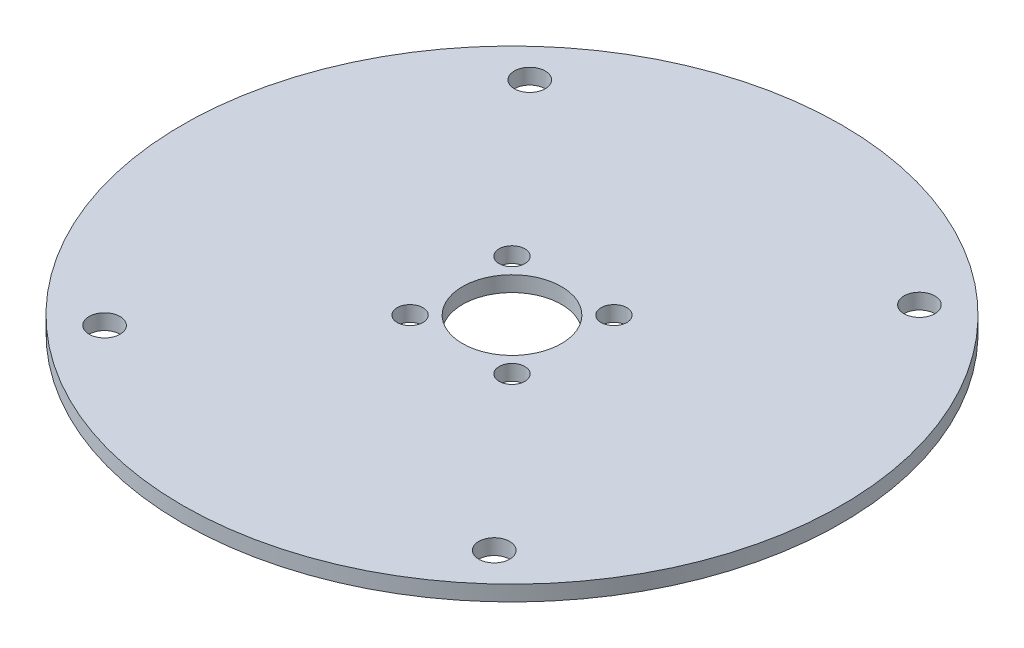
ISO-10303-21;
HEADER;
FILE_DESCRIPTION(('STEP AP214'),'2;1');
FILE_NAME('part.step','',(''),(''),'','','');
FILE_SCHEMA(('AUTOMOTIVE_DESIGN { 1 0 10303 214 1 1 1 1 }'));
ENDSEC;
DATA;
#1=APPLICATION_CONTEXT('core data for automotive mechanical design processes');
#2=APPLICATION_PROTOCOL_DEFINITION('international standard','automotive_design',2000,#1);
#3=PRODUCT_CONTEXT('',#1,'mechanical');
#4=PRODUCT('Part','Part','',(#3));
#5=PRODUCT_RELATED_PRODUCT_CATEGORY('part','',(#4));
#6=PRODUCT_DEFINITION_FORMATION('','',#4);
#7=PRODUCT_DEFINITION_CONTEXT('part definition',#1,'design');
#8=PRODUCT_DEFINITION('design','',#6,#7);
#9=PRODUCT_DEFINITION_SHAPE('','',#8);
#10=(LENGTH_UNIT() NAMED_UNIT(*) SI_UNIT(.MILLI.,.METRE.));
#11=(NAMED_UNIT(*) PLANE_ANGLE_UNIT() SI_UNIT($,.RADIAN.));
#12=(NAMED_UNIT(*) SI_UNIT($,.STERADIAN.) SOLID_ANGLE_UNIT());
#13=UNCERTAINTY_MEASURE_WITH_UNIT(LENGTH_MEASURE(1.E-05),#10,'distance_accuracy_value','');
#14=(GEOMETRIC_REPRESENTATION_CONTEXT(3) GLOBAL_UNCERTAINTY_ASSIGNED_CONTEXT((#13)) GLOBAL_UNIT_ASSIGNED_CONTEXT((#10,
#11,#12)) REPRESENTATION_CONTEXT('',''));
#15=CARTESIAN_POINT('',(0.,0.,0.));
#16=DIRECTION('',(0.,0.,1.));
#17=DIRECTION('',(1.,0.,0.));
#18=AXIS2_PLACEMENT_3D('',#15,#16,#17);
#19=CARTESIAN_POINT('',(0.,-1.5,0.));
#20=DIRECTION('',(0.,1.,0.));
#21=DIRECTION('',(0.,0.,1.));
#22=AXIS2_PLACEMENT_3D('',#19,#20,#21);
#23=CYLINDRICAL_SURFACE('',#22,32.);
#24=CARTESIAN_POINT('',(0.,-1.5,0.));
#25=DIRECTION('',(0.,1.,0.));
#26=DIRECTION('',(0.,0.,1.));
#27=AXIS2_PLACEMENT_3D('',#24,#25,#26);
#28=CIRCLE('',#27,32.);
#29=CARTESIAN_POINT('',(0.,-1.5,32.));
#30=VERTEX_POINT('',#29);
#31=EDGE_CURVE('E10',#30,#30,#28,.T.);
#32=ORIENTED_EDGE('',*,*,#31,.T.);
#33=EDGE_LOOP('',(#32));
#34=FACE_BOUND('',#33,.T.);
#35=CARTESIAN_POINT('',(0.,0.,0.));
#36=DIRECTION('',(0.,1.,0.));
#37=DIRECTION('',(0.,0.,1.));
#38=AXIS2_PLACEMENT_3D('',#35,#36,#37);
#39=CIRCLE('',#38,32.);
#40=CARTESIAN_POINT('',(0.,0.,32.));
#41=VERTEX_POINT('',#40);
#42=EDGE_CURVE('E45',#41,#41,#39,.T.);
#43=ORIENTED_EDGE('',*,*,#42,.F.);
#44=EDGE_LOOP('',(#43));
#45=FACE_BOUND('',#44,.T.);
#46=ADVANCED_FACE('F42',(#34,#45),#23,.T.);
#47=CARTESIAN_POINT('',(0.,-1.5,0.));
#48=DIRECTION('',(0.,1.,0.));
#49=DIRECTION('',(0.,0.,1.));
#50=AXIS2_PLACEMENT_3D('',#47,#48,#49);
#51=PLANE('',#50);
#52=CARTESIAN_POINT('',(-4.94974746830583,-1.5,4.94974746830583));
#53=DIRECTION('',(0.,1.,0.));
#54=DIRECTION('',(0.,0.,1.));
#55=AXIS2_PLACEMENT_3D('',#52,#53,#54);
#56=CIRCLE('',#55,1.25);
#57=CARTESIAN_POINT('',(-4.94974746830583,-1.5,6.19974746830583));
#58=VERTEX_POINT('',#57);
#59=EDGE_CURVE('E96',#58,#58,#56,.T.);
#60=ORIENTED_EDGE('',*,*,#59,.T.);
#61=EDGE_LOOP('',(#60));
#62=FACE_BOUND('',#61,.T.);
#63=CARTESIAN_POINT('',(4.94974746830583,-1.5,4.94974746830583));
#64=DIRECTION('',(0.,1.,0.));
#65=DIRECTION('',(0.,0.,1.));
#66=AXIS2_PLACEMENT_3D('',#63,#64,#65);
#67=CIRCLE('',#66,1.25);
#68=CARTESIAN_POINT('',(4.94974746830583,-1.5,6.19974746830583));
#69=VERTEX_POINT('',#68);
#70=EDGE_CURVE('E104',#69,#69,#67,.T.);
#71=ORIENTED_EDGE('',*,*,#70,.T.);
#72=EDGE_LOOP('',(#71));
#73=FACE_BOUND('',#72,.T.);
#74=CARTESIAN_POINT('',(4.94974746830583,-1.5,-4.94974746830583));
#75=DIRECTION('',(0.,1.,0.));
#76=DIRECTION('',(0.,0.,1.));
#77=AXIS2_PLACEMENT_3D('',#74,#75,#76);
#78=CIRCLE('',#77,1.25);
#79=CARTESIAN_POINT('',(4.94974746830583,-1.5,-3.69974746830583));
#80=VERTEX_POINT('',#79);
#81=EDGE_CURVE('E112',#80,#80,#78,.T.);
#82=ORIENTED_EDGE('',*,*,#81,.T.);
#83=EDGE_LOOP('',(#82));
#84=FACE_BOUND('',#83,.T.);
#85=CARTESIAN_POINT('',(-4.94974746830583,-1.5,-4.94974746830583));
#86=DIRECTION('',(0.,1.,0.));
#87=DIRECTION('',(0.,0.,1.));
#88=AXIS2_PLACEMENT_3D('',#85,#86,#87);
#89=CIRCLE('',#88,1.25);
#90=CARTESIAN_POINT('',(-4.94974746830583,-1.5,-3.69974746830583));
#91=VERTEX_POINT('',#90);
#92=EDGE_CURVE('E120',#91,#91,#89,.T.);
#93=ORIENTED_EDGE('',*,*,#92,.T.);
#94=EDGE_LOOP('',(#93));
#95=FACE_BOUND('',#94,.T.);
#96=CARTESIAN_POINT('',(0.,-1.5,0.));
#97=DIRECTION('',(0.,1.,0.));
#98=DIRECTION('',(0.,0.,1.));
#99=AXIS2_PLACEMENT_3D('',#96,#97,#98);
#100=CIRCLE('',#99,4.8);
#101=CARTESIAN_POINT('',(0.,-1.5,4.8));
#102=VERTEX_POINT('',#101);
#103=EDGE_CURVE('E84',#102,#102,#100,.T.);
#104=ORIENTED_EDGE('',*,*,#103,.T.);
#105=EDGE_LOOP('',(#104));
#106=FACE_BOUND('',#105,.T.);
#107=CARTESIAN_POINT('',(-18.9165258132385,-1.5,-20.6437654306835));
#108=DIRECTION('',(0.,1.,0.));
#109=DIRECTION('',(0.,0.,1.));
#110=AXIS2_PLACEMENT_3D('',#107,#108,#109);
#111=CIRCLE('',#110,1.5);
#112=CARTESIAN_POINT('',(-18.9165258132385,-1.5,-19.1437654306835));
#113=VERTEX_POINT('',#112);
#114=EDGE_CURVE('E73',#113,#113,#111,.T.);
#115=ORIENTED_EDGE('',*,*,#114,.T.);
#116=EDGE_LOOP('',(#115));
#117=FACE_BOUND('',#116,.T.);
#118=CARTESIAN_POINT('',(18.9165258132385,-1.5,20.6437654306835));
#119=DIRECTION('',(0.,1.,0.));
#120=DIRECTION('',(0.,0.,-1.));
#121=AXIS2_PLACEMENT_3D('',#118,#119,#120);
#122=CIRCLE('',#121,1.5);
#123=CARTESIAN_POINT('',(18.9165258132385,-1.5,19.1437654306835));
#124=VERTEX_POINT('',#123);
#125=EDGE_CURVE('E64',#124,#124,#122,.T.);
#126=ORIENTED_EDGE('',*,*,#125,.T.);
#127=EDGE_LOOP('',(#126));
#128=FACE_BOUND('',#127,.T.);
#129=CARTESIAN_POINT('',(-18.9165258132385,-1.5,20.6437654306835));
#130=DIRECTION('',(0.,1.,0.));
#131=DIRECTION('',(0.,0.,-1.));
#132=AXIS2_PLACEMENT_3D('',#129,#130,#131);
#133=CIRCLE('',#132,1.5);
#134=CARTESIAN_POINT('',(-18.9165258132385,-1.5,19.1437654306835));
#135=VERTEX_POINT('',#134);
#136=EDGE_CURVE('E80',#135,#135,#133,.T.);
#137=ORIENTED_EDGE('',*,*,#136,.T.);
#138=EDGE_LOOP('',(#137));
#139=FACE_BOUND('',#138,.T.);
#140=CARTESIAN_POINT('',(18.9165258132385,-1.5,-20.6437654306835));
#141=DIRECTION('',(0.,1.,0.));
#142=DIRECTION('',(0.,0.,1.));
#143=AXIS2_PLACEMENT_3D('',#140,#141,#142);
#144=CIRCLE('',#143,1.5);
#145=CARTESIAN_POINT('',(18.9165258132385,-1.5,-19.1437654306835));
#146=VERTEX_POINT('',#145);
#147=EDGE_CURVE('E54',#146,#146,#144,.T.);
#148=ORIENTED_EDGE('',*,*,#147,.T.);
#149=EDGE_LOOP('',(#148));
#150=FACE_BOUND('',#149,.T.);
#151=ORIENTED_EDGE('',*,*,#31,.F.);
#152=EDGE_LOOP('',(#151));
#153=FACE_BOUND('',#152,.T.);
#154=ADVANCED_FACE('F134',(#62,#73,#84,#95,#106,#117,#128,#139,#150,#153),#51,.F.);
#155=CARTESIAN_POINT('',(0.,0.,0.));
#156=DIRECTION('',(0.,1.,0.));
#157=DIRECTION('',(0.,0.,1.));
#158=AXIS2_PLACEMENT_3D('',#155,#156,#157);
#159=PLANE('',#158);
#160=CARTESIAN_POINT('',(-4.94974746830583,0.,4.94974746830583));
#161=DIRECTION('',(0.,1.,0.));
#162=DIRECTION('',(0.,0.,1.));
#163=AXIS2_PLACEMENT_3D('',#160,#161,#162);
#164=CIRCLE('',#163,1.25);
#165=CARTESIAN_POINT('',(-4.94974746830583,0.,6.19974746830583));
#166=VERTEX_POINT('',#165);
#167=EDGE_CURVE('E100',#166,#166,#164,.T.);
#168=ORIENTED_EDGE('',*,*,#167,.F.);
#169=EDGE_LOOP('',(#168));
#170=FACE_BOUND('',#169,.T.);
#171=CARTESIAN_POINT('',(4.94974746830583,0.,4.94974746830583));
#172=DIRECTION('',(0.,1.,0.));
#173=DIRECTION('',(0.,0.,1.));
#174=AXIS2_PLACEMENT_3D('',#171,#172,#173);
#175=CIRCLE('',#174,1.25);
#176=CARTESIAN_POINT('',(4.94974746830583,0.,6.19974746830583));
#177=VERTEX_POINT('',#176);
#178=EDGE_CURVE('E108',#177,#177,#175,.T.);
#179=ORIENTED_EDGE('',*,*,#178,.F.);
#180=EDGE_LOOP('',(#179));
#181=FACE_BOUND('',#180,.T.);
#182=CARTESIAN_POINT('',(4.94974746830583,0.,-4.94974746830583));
#183=DIRECTION('',(0.,1.,0.));
#184=DIRECTION('',(0.,0.,1.));
#185=AXIS2_PLACEMENT_3D('',#182,#183,#184);
#186=CIRCLE('',#185,1.25);
#187=CARTESIAN_POINT('',(4.94974746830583,0.,-3.69974746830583));
#188=VERTEX_POINT('',#187);
#189=EDGE_CURVE('E116',#188,#188,#186,.T.);
#190=ORIENTED_EDGE('',*,*,#189,.F.);
#191=EDGE_LOOP('',(#190));
#192=FACE_BOUND('',#191,.T.);
#193=CARTESIAN_POINT('',(-4.94974746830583,0.,-4.94974746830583));
#194=DIRECTION('',(0.,1.,0.));
#195=DIRECTION('',(0.,0.,1.));
#196=AXIS2_PLACEMENT_3D('',#193,#194,#195);
#197=CIRCLE('',#196,1.25);
#198=CARTESIAN_POINT('',(-4.94974746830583,0.,-3.69974746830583));
#199=VERTEX_POINT('',#198);
#200=EDGE_CURVE('E92',#199,#199,#197,.T.);
#201=ORIENTED_EDGE('',*,*,#200,.F.);
#202=EDGE_LOOP('',(#201));
#203=FACE_BOUND('',#202,.T.);
#204=CARTESIAN_POINT('',(0.,0.,0.));
#205=DIRECTION('',(0.,1.,0.));
#206=DIRECTION('',(0.,0.,1.));
#207=AXIS2_PLACEMENT_3D('',#204,#205,#206);
#208=CIRCLE('',#207,4.8);
#209=CARTESIAN_POINT('',(0.,0.,4.8));
#210=VERTEX_POINT('',#209);
#211=EDGE_CURVE('E88',#210,#210,#208,.T.);
#212=ORIENTED_EDGE('',*,*,#211,.F.);
#213=EDGE_LOOP('',(#212));
#214=FACE_BOUND('',#213,.T.);
#215=CARTESIAN_POINT('',(-18.9165258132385,0.,-20.6437654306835));
#216=DIRECTION('',(0.,1.,0.));
#217=DIRECTION('',(0.,0.,1.));
#218=AXIS2_PLACEMENT_3D('',#215,#216,#217);
#219=CIRCLE('',#218,1.5);
#220=CARTESIAN_POINT('',(-18.9165258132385,0.,-19.1437654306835));
#221=VERTEX_POINT('',#220);
#222=EDGE_CURVE('E60',#221,#221,#219,.T.);
#223=ORIENTED_EDGE('',*,*,#222,.F.);
#224=EDGE_LOOP('',(#223));
#225=FACE_BOUND('',#224,.T.);
#226=CARTESIAN_POINT('',(18.9165258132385,0.,20.6437654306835));
#227=DIRECTION('',(0.,1.,0.));
#228=DIRECTION('',(0.,0.,-1.));
#229=AXIS2_PLACEMENT_3D('',#226,#227,#228);
#230=CIRCLE('',#229,1.5);
#231=CARTESIAN_POINT('',(18.9165258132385,0.,19.1437654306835));
#232=VERTEX_POINT('',#231);
#233=EDGE_CURVE('E68',#232,#232,#230,.T.);
#234=ORIENTED_EDGE('',*,*,#233,.F.);
#235=EDGE_LOOP('',(#234));
#236=FACE_BOUND('',#235,.T.);
#237=CARTESIAN_POINT('',(-18.9165258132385,0.,20.6437654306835));
#238=DIRECTION('',(0.,1.,0.));
#239=DIRECTION('',(0.,0.,-1.));
#240=AXIS2_PLACEMENT_3D('',#237,#238,#239);
#241=CIRCLE('',#240,1.5);
#242=CARTESIAN_POINT('',(-18.9165258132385,0.,19.1437654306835));
#243=VERTEX_POINT('',#242);
#244=EDGE_CURVE('E69',#243,#243,#241,.T.);
#245=ORIENTED_EDGE('',*,*,#244,.F.);
#246=EDGE_LOOP('',(#245));
#247=FACE_BOUND('',#246,.T.);
#248=CARTESIAN_POINT('',(18.9165258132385,0.,-20.6437654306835));
#249=DIRECTION('',(0.,1.,0.));
#250=DIRECTION('',(0.,0.,1.));
#251=AXIS2_PLACEMENT_3D('',#248,#249,#250);
#252=CIRCLE('',#251,1.5);
#253=CARTESIAN_POINT('',(18.9165258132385,0.,-19.1437654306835));
#254=VERTEX_POINT('',#253);
#255=EDGE_CURVE('E56',#254,#254,#252,.T.);
#256=ORIENTED_EDGE('',*,*,#255,.F.);
#257=EDGE_LOOP('',(#256));
#258=FACE_BOUND('',#257,.T.);
#259=ORIENTED_EDGE('',*,*,#42,.T.);
#260=EDGE_LOOP('',(#259));
#261=FACE_BOUND('',#260,.T.);
#262=ADVANCED_FACE('F130',(#170,#181,#192,#203,#214,#225,#236,#247,#258,#261),#159,.T.);
#263=CARTESIAN_POINT('',(18.9165258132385,-1.5,-20.6437654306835));
#264=DIRECTION('',(0.,1.,0.));
#265=DIRECTION('',(0.,0.,1.));
#266=AXIS2_PLACEMENT_3D('',#263,#264,#265);
#267=CYLINDRICAL_SURFACE('',#266,1.5);
#268=ORIENTED_EDGE('',*,*,#147,.F.);
#269=EDGE_LOOP('',(#268));
#270=FACE_BOUND('',#269,.T.);
#271=ORIENTED_EDGE('',*,*,#255,.T.);
#272=EDGE_LOOP('',(#271));
#273=FACE_BOUND('',#272,.T.);
#274=ADVANCED_FACE('F133',(#270,#273),#267,.F.);
#275=CARTESIAN_POINT('',(-18.9165258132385,-1.5,20.6437654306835));
#276=DIRECTION('',(0.,1.,0.));
#277=DIRECTION('',(0.,0.,1.));
#278=AXIS2_PLACEMENT_3D('',#275,#276,#277);
#279=CYLINDRICAL_SURFACE('',#278,1.5);
#280=ORIENTED_EDGE('',*,*,#136,.F.);
#281=EDGE_LOOP('',(#280));
#282=FACE_BOUND('',#281,.T.);
#283=ORIENTED_EDGE('',*,*,#244,.T.);
#284=EDGE_LOOP('',(#283));
#285=FACE_BOUND('',#284,.T.);
#286=ADVANCED_FACE('F160',(#282,#285),#279,.F.);
#287=CARTESIAN_POINT('',(18.9165258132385,-1.5,20.6437654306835));
#288=DIRECTION('',(0.,1.,0.));
#289=DIRECTION('',(0.,0.,1.));
#290=AXIS2_PLACEMENT_3D('',#287,#288,#289);
#291=CYLINDRICAL_SURFACE('',#290,1.5);
#292=ORIENTED_EDGE('',*,*,#125,.F.);
#293=EDGE_LOOP('',(#292));
#294=FACE_BOUND('',#293,.T.);
#295=ORIENTED_EDGE('',*,*,#233,.T.);
#296=EDGE_LOOP('',(#295));
#297=FACE_BOUND('',#296,.T.);
#298=ADVANCED_FACE('F162',(#294,#297),#291,.F.);
#299=CARTESIAN_POINT('',(-18.9165258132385,-1.5,-20.6437654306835));
#300=DIRECTION('',(0.,1.,0.));
#301=DIRECTION('',(0.,0.,1.));
#302=AXIS2_PLACEMENT_3D('',#299,#300,#301);
#303=CYLINDRICAL_SURFACE('',#302,1.5);
#304=ORIENTED_EDGE('',*,*,#114,.F.);
#305=EDGE_LOOP('',(#304));
#306=FACE_BOUND('',#305,.T.);
#307=ORIENTED_EDGE('',*,*,#222,.T.);
#308=EDGE_LOOP('',(#307));
#309=FACE_BOUND('',#308,.T.);
#310=ADVANCED_FACE('F165',(#306,#309),#303,.F.);
#311=CARTESIAN_POINT('',(0.,-1.5,0.));
#312=DIRECTION('',(0.,1.,0.));
#313=DIRECTION('',(0.,0.,1.));
#314=AXIS2_PLACEMENT_3D('',#311,#312,#313);
#315=CYLINDRICAL_SURFACE('',#314,4.8);
#316=ORIENTED_EDGE('',*,*,#103,.F.);
#317=EDGE_LOOP('',(#316));
#318=FACE_BOUND('',#317,.T.);
#319=ORIENTED_EDGE('',*,*,#211,.T.);
#320=EDGE_LOOP('',(#319));
#321=FACE_BOUND('',#320,.T.);
#322=ADVANCED_FACE('F169',(#318,#321),#315,.F.);
#323=CARTESIAN_POINT('',(-4.94974746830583,-1.5,-4.94974746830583));
#324=DIRECTION('',(0.,1.,0.));
#325=DIRECTION('',(0.,0.,1.));
#326=AXIS2_PLACEMENT_3D('',#323,#324,#325);
#327=CYLINDRICAL_SURFACE('',#326,1.25);
#328=ORIENTED_EDGE('',*,*,#92,.F.);
#329=EDGE_LOOP('',(#328));
#330=FACE_BOUND('',#329,.T.);
#331=ORIENTED_EDGE('',*,*,#200,.T.);
#332=EDGE_LOOP('',(#331));
#333=FACE_BOUND('',#332,.T.);
#334=ADVANCED_FACE('F128',(#330,#333),#327,.F.);
#335=CARTESIAN_POINT('',(4.94974746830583,-1.5,-4.94974746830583));
#336=DIRECTION('',(0.,1.,0.));
#337=DIRECTION('',(0.,0.,1.));
#338=AXIS2_PLACEMENT_3D('',#335,#336,#337);
#339=CYLINDRICAL_SURFACE('',#338,1.25);
#340=ORIENTED_EDGE('',*,*,#81,.F.);
#341=EDGE_LOOP('',(#340));
#342=FACE_BOUND('',#341,.T.);
#343=ORIENTED_EDGE('',*,*,#189,.T.);
#344=EDGE_LOOP('',(#343));
#345=FACE_BOUND('',#344,.T.);
#346=ADVANCED_FACE('F184',(#342,#345),#339,.F.);
#347=CARTESIAN_POINT('',(4.94974746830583,-1.5,4.94974746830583));
#348=DIRECTION('',(0.,1.,0.));
#349=DIRECTION('',(0.,0.,1.));
#350=AXIS2_PLACEMENT_3D('',#347,#348,#349);
#351=CYLINDRICAL_SURFACE('',#350,1.25);
#352=ORIENTED_EDGE('',*,*,#70,.F.);
#353=EDGE_LOOP('',(#352));
#354=FACE_BOUND('',#353,.T.);
#355=ORIENTED_EDGE('',*,*,#178,.T.);
#356=EDGE_LOOP('',(#355));
#357=FACE_BOUND('',#356,.T.);
#358=ADVANCED_FACE('F180',(#354,#357),#351,.F.);
#359=CARTESIAN_POINT('',(-4.94974746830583,-1.5,4.94974746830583));
#360=DIRECTION('',(0.,1.,0.));
#361=DIRECTION('',(0.,0.,1.));
#362=AXIS2_PLACEMENT_3D('',#359,#360,#361);
#363=CYLINDRICAL_SURFACE('',#362,1.25);
#364=ORIENTED_EDGE('',*,*,#59,.F.);
#365=EDGE_LOOP('',(#364));
#366=FACE_BOUND('',#365,.T.);
#367=ORIENTED_EDGE('',*,*,#167,.T.);
#368=EDGE_LOOP('',(#367));
#369=FACE_BOUND('',#368,.T.);
#370=ADVANCED_FACE('F177',(#366,#369),#363,.F.);
#371=CLOSED_SHELL('',(#46,#154,#262,#274,#286,#298,#310,#322,#334,#346,#358,#370));
#372=MANIFOLD_SOLID_BREP('B2',#371);
#373=ADVANCED_BREP_SHAPE_REPRESENTATION('',(#18,#372),#14);
#374=SHAPE_DEFINITION_REPRESENTATION(#9,#373);
ENDSEC;
END-ISO-10303-21;
